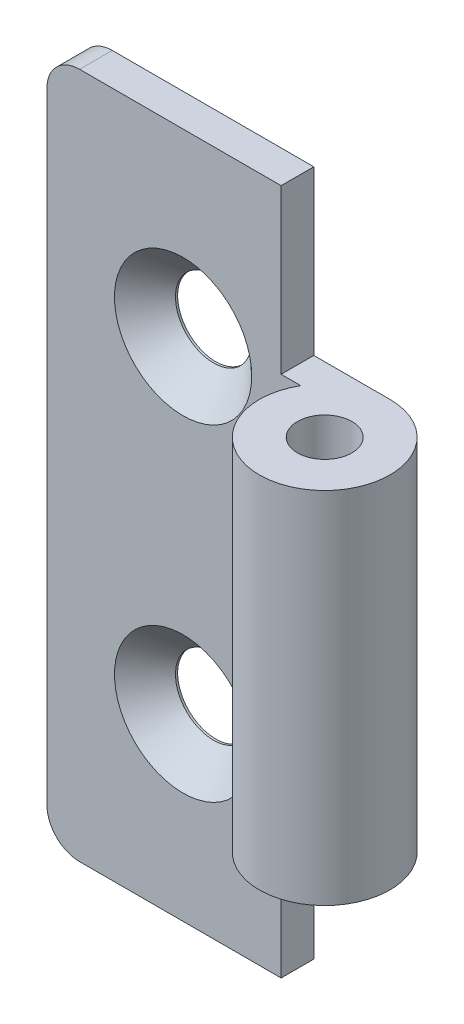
from build123d import *

# Parameters (mm, degrees)
EXTRUDE_1_DEPTH             = 63
SKETCH_2_W                  = 20.513908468
SKETCH_2_H                  = 15
CUT_EXTRUDE_2_DEPTH         = 71.180125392
FILLET_1_R                  = 3
HOLE_WIZARD_M6_1_AT_2_COUNT = 2
HOLE_WIZARD_M6_1_AT_2_PITCH = 30
SKETCH_5_R                  = 2.5
CUT_EXTRUDE_3_DEPTH         = 57.144901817


with BuildPart() as part:
    # Sketch 1 → Extrude 1 (new body)
    with BuildSketch(Plane(origin=(0, 0, 0), x_dir=(1, 0, 0), z_dir=(0, 1, 0))):
        with BuildLine():
            Line((0, 6), (-28.5, 6))
            Line((-28.5, 6), (-28.5, 3))
            Line((-28.5, 3), (-5.196152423, 3))
            ThreePointArc((-5.196152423, 3), (3, -5.196152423), (0, 6))
        make_face()
    extrude(amount=EXTRUDE_1_DEPTH)

    # Sketch 2 → Cut-Extrude 2 (cut, through all)
    with BuildSketch(Plane(origin=(0, 0, -6), x_dir=(-1, 0, 0), z_dir=(0, 0, -1))):
        with Locations((-3.256954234, 55.5)):
            Rectangle(SKETCH_2_W, SKETCH_2_H)
        with Locations((-3.256954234, 7.5)):
            Rectangle(SKETCH_2_W, SKETCH_2_H)
    extrude(amount=-CUT_EXTRUDE_2_DEPTH, mode=Mode.SUBTRACT)

    # Fillet 1
    fillet_1_edges = [part.edges().sort_by_distance(p)[0] for p in [
        (-28.5, 63, -4.5),
        (-28.5, 0, -4.5),
    ]]
    fillet(fillet_1_edges, radius=FILLET_1_R)

    # Sketch 3 → Hole Wizard M6 _1 (revolve, cut)
    with BuildSketch(Plane(origin=(-16, 46.5, -3), x_dir=(0, -1, 0), z_dir=(1, 0, 0))):
        Polygon((0, 0), (0, 3), (3.5, 3), (3.5, 2.8), (6.3, 0), align=None)
    hole_wizard_m6_1 = revolve(axis=Axis((-16, 46.5, 3.35), (0, 0, -1)), mode=Mode.SUBTRACT)

    # Hole Wizard M6 _1 at 2: Hole Wizard M6 _1 ×2
    with Locations(*[(0, -i * HOLE_WIZARD_M6_1_AT_2_PITCH, 0) for i in range(1, HOLE_WIZARD_M6_1_AT_2_COUNT)]):
        add(hole_wizard_m6_1, mode=Mode.SUBTRACT)

    # Sketch 5 → Cut-Extrude 3 (cut, through all)
    with BuildSketch(Plane(origin=(0, 48, 0), x_dir=(1, 0, 0), z_dir=(0, 1, 0))):
        with Locations(Location((0, 0, 0), (0, 0, 270))):
            Circle(SKETCH_5_R)
    extrude(amount=-CUT_EXTRUDE_3_DEPTH, mode=Mode.SUBTRACT)


solid = part.part
